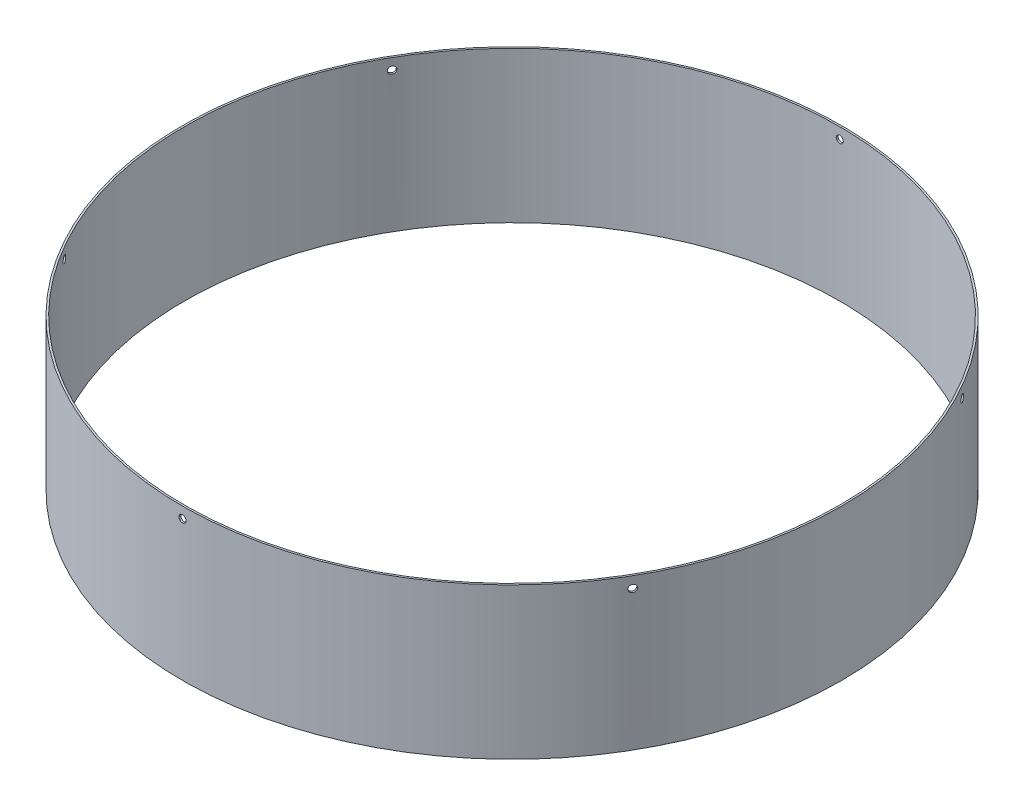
from build123d import *

# Parameters (mm, degrees)
SKETCH1_R          = 152.4127
SKETCH1_R_2        = 151.5491
EXTRUDE1_DEPTH     = 69.85
SKETCH2_R          = 1.63195
CUT_EXTRUDE1_DEPTH = 227.57953293
CIRPATTERN1_COUNT  = 6
SKETCH3_W          = 163.742300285
SKETCH3_H          = 0.00254
CUT_EXTRUDE2_DEPTH = 227.579533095


with BuildPart() as part:
    # Sketch1 → Extrude1 (new body)
    with BuildSketch(Plane(origin=(0, 0, 0), x_dir=(1, 0, 0), z_dir=(0, 1, 0))):
        with Locations(Location((0, 0, 0), (0, 0, 270))):
            Circle(SKETCH1_R)
        with Locations(Location((0, 0, 0), (0, 0, 270))):
            Circle(SKETCH1_R_2, mode=Mode.SUBTRACT)
    extrude(amount=EXTRUDE1_DEPTH)

    # Sketch2 → Cut-Extrude1 (cut, through all)
    with BuildSketch(Plane.XY):
        with Locations(Location((0, 64.77, 0), (0, 0, 90))):
            Circle(SKETCH2_R)
    cut_extrude1 = extrude(amount=-CUT_EXTRUDE1_DEPTH, mode=Mode.SUBTRACT)

    # CirPattern1: Cut-Extrude1 ×6 about axis
    cirpattern1_axis = Axis((0, 69.85, 0), (0, -1, 0))
    for i in range(1, CIRPATTERN1_COUNT):
        add(cut_extrude1.rotate(cirpattern1_axis, i * 360 / CIRPATTERN1_COUNT), mode=Mode.SUBTRACT)

    # Sketch3 → Cut-Extrude2 (cut, through all)
    with BuildSketch(Plane(origin=(0, 69.85, 0), x_dir=(-1, 0, 0), z_dir=(0, 1, 0))):
        with Locations((-81.871150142, 0.00127)):
            Rectangle(SKETCH3_W, SKETCH3_H)
    extrude(amount=-CUT_EXTRUDE2_DEPTH, mode=Mode.SUBTRACT)


solid = part.part
